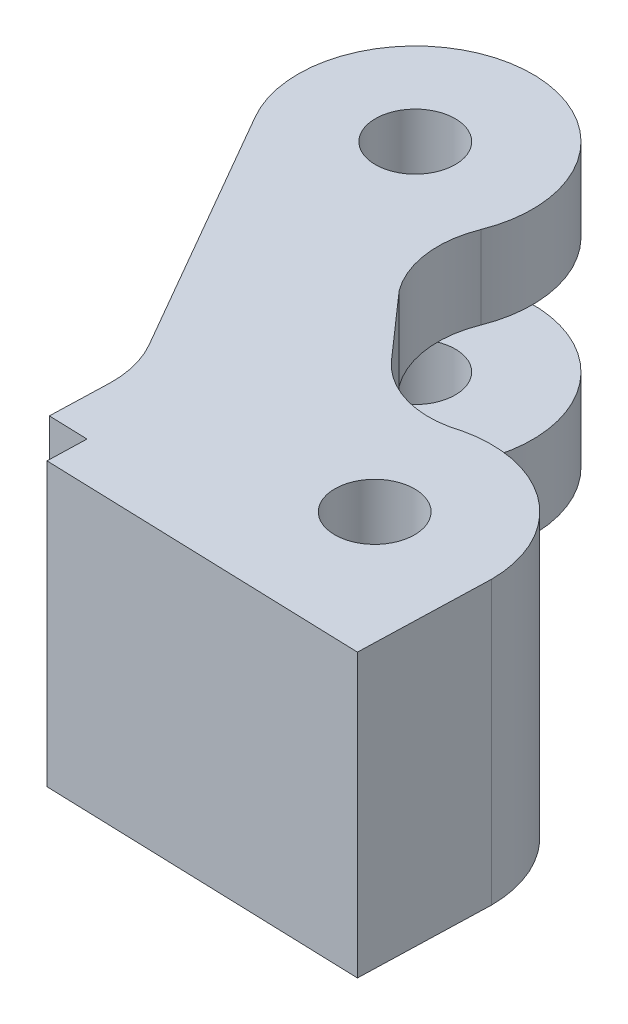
ISO-10303-21;
HEADER;
FILE_DESCRIPTION(('STEP AP214'),'2;1');
FILE_NAME('part.step','',(''),(''),'','','');
FILE_SCHEMA(('AUTOMOTIVE_DESIGN { 1 0 10303 214 1 1 1 1 }'));
ENDSEC;
DATA;
#1=APPLICATION_CONTEXT('core data for automotive mechanical design processes');
#2=APPLICATION_PROTOCOL_DEFINITION('international standard','automotive_design',2000,#1);
#3=PRODUCT_CONTEXT('',#1,'mechanical');
#4=PRODUCT('Part','Part','',(#3));
#5=PRODUCT_RELATED_PRODUCT_CATEGORY('part','',(#4));
#6=PRODUCT_DEFINITION_FORMATION('','',#4);
#7=PRODUCT_DEFINITION_CONTEXT('part definition',#1,'design');
#8=PRODUCT_DEFINITION('design','',#6,#7);
#9=PRODUCT_DEFINITION_SHAPE('','',#8);
#10=(LENGTH_UNIT() NAMED_UNIT(*) SI_UNIT(.MILLI.,.METRE.));
#11=(NAMED_UNIT(*) PLANE_ANGLE_UNIT() SI_UNIT($,.RADIAN.));
#12=(NAMED_UNIT(*) SI_UNIT($,.STERADIAN.) SOLID_ANGLE_UNIT());
#13=UNCERTAINTY_MEASURE_WITH_UNIT(LENGTH_MEASURE(1.E-05),#10,'distance_accuracy_value','');
#14=(GEOMETRIC_REPRESENTATION_CONTEXT(3) GLOBAL_UNCERTAINTY_ASSIGNED_CONTEXT((#13)) GLOBAL_UNIT_ASSIGNED_CONTEXT((#10,
#11,#12)) REPRESENTATION_CONTEXT('',''));
#15=CARTESIAN_POINT('',(0.,0.,0.));
#16=DIRECTION('',(0.,0.,1.));
#17=DIRECTION('',(1.,0.,0.));
#18=AXIS2_PLACEMENT_3D('',#15,#16,#17);
#19=CARTESIAN_POINT('',(10.2386390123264,-7.25,4.07669644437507));
#20=DIRECTION('',(0.,1.,0.));
#21=DIRECTION('',(0.,0.,1.));
#22=AXIS2_PLACEMENT_3D('',#19,#20,#21);
#23=CYLINDRICAL_SURFACE('',#22,5.);
#24=DIRECTION('',(0.,1.,0.));
#25=VECTOR('',#24,1.);
#26=CARTESIAN_POINT('',(5.59332649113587,-7.25,2.22708254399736));
#27=LINE('',#26,#25);
#28=CARTESIAN_POINT('',(5.59332649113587,-7.25,2.22708254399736));
#29=VERTEX_POINT('',#28);
#30=CARTESIAN_POINT('',(5.59332649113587,-3.,2.22708254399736));
#31=VERTEX_POINT('',#30);
#32=EDGE_CURVE('E263',#29,#31,#27,.T.);
#33=ORIENTED_EDGE('',*,*,#32,.T.);
#34=CARTESIAN_POINT('',(10.2386390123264,-3.,4.07669644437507));
#35=DIRECTION('',(0.,1.,0.));
#36=DIRECTION('',(0.,0.,1.));
#37=AXIS2_PLACEMENT_3D('',#34,#35,#36);
#38=CIRCLE('',#37,5.);
#39=CARTESIAN_POINT('',(6.2041296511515,-3.,7.03012398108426));
#40=VERTEX_POINT('',#39);
#41=EDGE_CURVE('E151',#31,#40,#38,.T.);
#42=ORIENTED_EDGE('',*,*,#41,.T.);
#43=DIRECTION('',(0.,1.,0.));
#44=VECTOR('',#43,1.);
#45=CARTESIAN_POINT('',(6.2041296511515,-7.25,7.03012398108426));
#46=LINE('',#45,#44);
#47=CARTESIAN_POINT('',(6.2041296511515,-7.25,7.03012398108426));
#48=VERTEX_POINT('',#47);
#49=EDGE_CURVE('E266',#48,#40,#46,.T.);
#50=ORIENTED_EDGE('',*,*,#49,.F.);
#51=CARTESIAN_POINT('',(10.2386390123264,-7.25,4.07669644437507));
#52=DIRECTION('',(0.,-1.,0.));
#53=DIRECTION('',(0.,0.,1.));
#54=AXIS2_PLACEMENT_3D('',#51,#52,#53);
#55=CIRCLE('',#54,5.);
#56=EDGE_CURVE('E245',#48,#29,#55,.T.);
#57=ORIENTED_EDGE('',*,*,#56,.T.);
#58=EDGE_LOOP('',(#33,#42,#50,#57));
#59=FACE_BOUND('',#58,.T.);
#60=ADVANCED_FACE('F36',(#59),#23,.F.);
#61=CARTESIAN_POINT('',(0.,-7.25,0.));
#62=DIRECTION('',(0.,1.,0.));
#63=DIRECTION('',(0.,0.,1.));
#64=AXIS2_PLACEMENT_3D('',#61,#62,#63);
#65=CYLINDRICAL_SURFACE('',#64,2.05);
#66=CARTESIAN_POINT('',(0.,-7.25,0.));
#67=DIRECTION('',(0.,1.,0.));
#68=DIRECTION('',(0.,0.,1.));
#69=AXIS2_PLACEMENT_3D('',#66,#67,#68);
#70=CIRCLE('',#69,2.05);
#71=CARTESIAN_POINT('',(0.,-7.25,2.05));
#72=VERTEX_POINT('',#71);
#73=EDGE_CURVE('E219',#72,#72,#70,.T.);
#74=CARTESIAN_POINT('',(0.,-3.,0.));
#75=DIRECTION('',(0.,1.,0.));
#76=DIRECTION('',(0.,0.,1.));
#77=AXIS2_PLACEMENT_3D('',#74,#75,#76);
#78=CIRCLE('',#77,2.05);
#79=CARTESIAN_POINT('',(0.,-3.,2.05));
#80=VERTEX_POINT('',#79);
#81=EDGE_CURVE('E283',#80,#80,#78,.F.);
#82=CARTESIAN_POINT('',(0.,-7.25,2.05));
#83=CARTESIAN_POINT('',(0.,-7.20572916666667,2.05));
#84=CARTESIAN_POINT('',(0.,-7.16145833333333,2.05));
#85=CARTESIAN_POINT('',(0.,-7.07291666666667,2.05));
#86=CARTESIAN_POINT('',(0.,-7.02864583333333,2.05));
#87=CARTESIAN_POINT('',(0.,-6.94010416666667,2.05));
#88=CARTESIAN_POINT('',(0.,-6.89583333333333,2.05));
#89=CARTESIAN_POINT('',(0.,-6.80729166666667,2.05));
#90=CARTESIAN_POINT('',(0.,-6.76302083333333,2.05));
#91=CARTESIAN_POINT('',(0.,-6.67447916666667,2.05));
#92=CARTESIAN_POINT('',(0.,-6.63020833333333,2.05));
#93=CARTESIAN_POINT('',(0.,-6.54166666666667,2.05));
#94=CARTESIAN_POINT('',(0.,-6.49739583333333,2.05));
#95=CARTESIAN_POINT('',(0.,-6.40885416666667,2.05));
#96=CARTESIAN_POINT('',(0.,-6.36458333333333,2.05));
#97=CARTESIAN_POINT('',(0.,-6.27604166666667,2.05));
#98=CARTESIAN_POINT('',(0.,-6.23177083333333,2.05));
#99=CARTESIAN_POINT('',(0.,-6.14322916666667,2.05));
#100=CARTESIAN_POINT('',(0.,-6.09895833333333,2.05));
#101=CARTESIAN_POINT('',(0.,-6.01041666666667,2.05));
#102=CARTESIAN_POINT('',(0.,-5.96614583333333,2.05));
#103=CARTESIAN_POINT('',(0.,-5.87760416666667,2.05));
#104=CARTESIAN_POINT('',(0.,-5.83333333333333,2.05));
#105=CARTESIAN_POINT('',(0.,-5.74479166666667,2.05));
#106=CARTESIAN_POINT('',(0.,-5.70052083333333,2.05));
#107=CARTESIAN_POINT('',(0.,-5.61197916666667,2.05));
#108=CARTESIAN_POINT('',(0.,-5.56770833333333,2.05));
#109=CARTESIAN_POINT('',(0.,-5.47916666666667,2.05));
#110=CARTESIAN_POINT('',(0.,-5.43489583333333,2.05));
#111=CARTESIAN_POINT('',(0.,-5.34635416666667,2.05));
#112=CARTESIAN_POINT('',(0.,-5.30208333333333,2.05));
#113=CARTESIAN_POINT('',(0.,-5.21354166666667,2.05));
#114=CARTESIAN_POINT('',(0.,-5.16927083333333,2.05));
#115=CARTESIAN_POINT('',(0.,-5.08072916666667,2.05));
#116=CARTESIAN_POINT('',(0.,-5.03645833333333,2.05));
#117=CARTESIAN_POINT('',(0.,-4.94791666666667,2.05));
#118=CARTESIAN_POINT('',(0.,-4.90364583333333,2.05));
#119=CARTESIAN_POINT('',(0.,-4.81510416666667,2.05));
#120=CARTESIAN_POINT('',(0.,-4.77083333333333,2.05));
#121=CARTESIAN_POINT('',(0.,-4.68229166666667,2.05));
#122=CARTESIAN_POINT('',(0.,-4.63802083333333,2.05));
#123=CARTESIAN_POINT('',(0.,-4.54947916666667,2.05));
#124=CARTESIAN_POINT('',(0.,-4.50520833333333,2.05));
#125=CARTESIAN_POINT('',(0.,-4.41666666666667,2.05));
#126=CARTESIAN_POINT('',(0.,-4.37239583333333,2.05));
#127=CARTESIAN_POINT('',(0.,-4.28385416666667,2.05));
#128=CARTESIAN_POINT('',(0.,-4.23958333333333,2.05));
#129=CARTESIAN_POINT('',(0.,-4.15104166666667,2.05));
#130=CARTESIAN_POINT('',(0.,-4.10677083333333,2.05));
#131=CARTESIAN_POINT('',(0.,-4.01822916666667,2.05));
#132=CARTESIAN_POINT('',(0.,-3.97395833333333,2.05));
#133=CARTESIAN_POINT('',(0.,-3.88541666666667,2.05));
#134=CARTESIAN_POINT('',(0.,-3.84114583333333,2.05));
#135=CARTESIAN_POINT('',(0.,-3.75260416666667,2.05));
#136=CARTESIAN_POINT('',(0.,-3.70833333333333,2.05));
#137=CARTESIAN_POINT('',(0.,-3.61979166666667,2.05));
#138=CARTESIAN_POINT('',(0.,-3.57552083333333,2.05));
#139=CARTESIAN_POINT('',(0.,-3.48697916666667,2.05));
#140=CARTESIAN_POINT('',(0.,-3.44270833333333,2.05));
#141=CARTESIAN_POINT('',(0.,-3.35416666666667,2.05));
#142=CARTESIAN_POINT('',(0.,-3.30989583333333,2.05));
#143=CARTESIAN_POINT('',(0.,-3.22135416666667,2.05));
#144=CARTESIAN_POINT('',(0.,-3.17708333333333,2.05));
#145=CARTESIAN_POINT('',(0.,-3.08854166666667,2.05));
#146=CARTESIAN_POINT('',(0.,-3.04427083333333,2.05));
#147=CARTESIAN_POINT('',(0.,-3.,2.05));
#148=B_SPLINE_CURVE_WITH_KNOTS('',3,(#82,#83,#84,#85,#86,#87,#88,#89,#90,#91,#92,#93,#94,#95,
#96,#97,#98,#99,#100,#101,#102,#103,#104,#105,#106,#107,#108,#109,#110,#111,#112,#113,#114,#115,
#116,#117,#118,#119,#120,#121,#122,#123,#124,#125,#126,#127,#128,#129,#130,#131,#132,#133,#134,
#135,#136,#137,#138,#139,#140,#141,#142,#143,#144,#145,#146,#147),.UNSPECIFIED.,.F.,.F.,(4,2,2,
2,2,2,2,2,2,2,2,2,2,2,2,2,2,2,2,2,2,2,2,2,2,2,2,2,2,2,2,2,4),(0.,0.1328125,0.265625,0.3984375,
0.53125,0.664062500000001,0.796875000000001,0.929687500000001,1.0625,1.1953125,1.328125,
1.4609375,1.59375,1.7265625,1.859375,1.9921875,2.125,2.2578125,2.390625,2.5234375,2.65625,
2.7890625,2.921875,3.0546875,3.1875,3.3203125,3.453125,3.5859375,3.71875,3.8515625,3.984375,
4.1171875,4.25),.UNSPECIFIED.);
#149=EDGE_CURVE('BSEAM333',#72,#80,#148,.T.);
#150=ORIENTED_EDGE('',*,*,#73,.F.);
#151=ORIENTED_EDGE('',*,*,#81,.F.);
#152=ORIENTED_EDGE('',*,*,#149,.T.);
#153=ORIENTED_EDGE('',*,*,#149,.F.);
#154=EDGE_LOOP('',(#150,#152,#151,#153));
#155=FACE_BOUND('',#154,.T.);
#156=ADVANCED_FACE('F333',(#155),#65,.F.);
#157=CARTESIAN_POINT('',(2.80122668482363,-7.25,21.6021556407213));
#158=DIRECTION('',(-0.999512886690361,0.,-0.031208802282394));
#159=DIRECTION('',(-0.031208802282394,0.,0.999512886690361));
#160=AXIS2_PLACEMENT_3D('',#157,#158,#159);
#161=PLANE('',#160);
#162=DIRECTION('',(0.,1.,0.));
#163=VECTOR('',#162,1.);
#164=CARTESIAN_POINT('',(2.80122668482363,-7.25,21.6021556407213));
#165=LINE('',#164,#163);
#166=CARTESIAN_POINT('',(2.80122668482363,-7.25,21.6021556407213));
#167=VERTEX_POINT('',#166);
#168=CARTESIAN_POINT('',(2.80122668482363,7.25,21.6021556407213));
#169=VERTEX_POINT('',#168);
#170=EDGE_CURVE('E257',#167,#169,#165,.T.);
#171=ORIENTED_EDGE('',*,*,#170,.T.);
#172=DIRECTION('',(-0.031208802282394,0.,0.999512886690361));
#173=VECTOR('',#172,1.);
#174=CARTESIAN_POINT('',(2.80122668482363,7.25,21.6021556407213));
#175=LINE('',#174,#173);
#176=CARTESIAN_POINT('',(2.89659587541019,7.25,18.5478014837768));
#177=VERTEX_POINT('',#176);
#178=EDGE_CURVE('E180',#177,#169,#175,.T.);
#179=ORIENTED_EDGE('',*,*,#178,.F.);
#180=DIRECTION('',(0.,1.,0.));
#181=VECTOR('',#180,1.);
#182=CARTESIAN_POINT('',(2.89659587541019,-7.25,18.5478014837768));
#183=LINE('',#182,#181);
#184=CARTESIAN_POINT('',(2.89659587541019,-7.25,18.5478014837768));
#185=VERTEX_POINT('',#184);
#186=EDGE_CURVE('E44',#185,#177,#183,.T.);
#187=ORIENTED_EDGE('',*,*,#186,.F.);
#188=DIRECTION('',(-0.031208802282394,0.,0.999512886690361));
#189=VECTOR('',#188,1.);
#190=CARTESIAN_POINT('',(2.80122668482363,-7.25,21.6021556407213));
#191=LINE('',#190,#189);
#192=EDGE_CURVE('E222',#185,#167,#191,.T.);
#193=ORIENTED_EDGE('',*,*,#192,.T.);
#194=EDGE_LOOP('',(#171,#179,#187,#193));
#195=FACE_BOUND('',#194,.T.);
#196=ADVANCED_FACE('F38',(#195),#161,.T.);
#197=CARTESIAN_POINT('',(-2.28185983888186,-7.25,18.4697341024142));
#198=DIRECTION('',(0.,1.,0.));
#199=DIRECTION('',(0.,0.,1.));
#200=AXIS2_PLACEMENT_3D('',#197,#198,#199);
#201=CYLINDRICAL_SURFACE('',#200,5.17904413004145);
#202=ORIENTED_EDGE('',*,*,#186,.T.);
#203=CARTESIAN_POINT('',(-2.28185983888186,7.25,18.4697341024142));
#204=DIRECTION('',(0.,-1.,0.));
#205=DIRECTION('',(0.,0.,-1.));
#206=AXIS2_PLACEMENT_3D('',#203,#204,#205);
#207=CIRCLE('',#206,5.17904413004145);
#208=CARTESIAN_POINT('',(2.20533949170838,7.25,15.8837062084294));
#209=VERTEX_POINT('',#208);
#210=EDGE_CURVE('E213',#209,#177,#207,.T.);
#211=ORIENTED_EDGE('',*,*,#210,.F.);
#212=DIRECTION('',(0.,1.,0.));
#213=VECTOR('',#212,1.);
#214=CARTESIAN_POINT('',(2.20533949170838,-7.25,15.8837062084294));
#215=LINE('',#214,#213);
#216=CARTESIAN_POINT('',(2.20533949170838,-7.25,15.8837062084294));
#217=VERTEX_POINT('',#216);
#218=EDGE_CURVE('E259',#217,#209,#215,.T.);
#219=ORIENTED_EDGE('',*,*,#218,.F.);
#220=CARTESIAN_POINT('',(-2.28185983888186,-7.25,18.4697341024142));
#221=DIRECTION('',(0.,-1.,0.));
#222=DIRECTION('',(0.,0.,-1.));
#223=AXIS2_PLACEMENT_3D('',#220,#221,#222);
#224=CIRCLE('',#223,5.17904413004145);
#225=EDGE_CURVE('E254',#217,#185,#224,.T.);
#226=ORIENTED_EDGE('',*,*,#225,.T.);
#227=EDGE_LOOP('',(#202,#211,#219,#226));
#228=FACE_BOUND('',#227,.T.);
#229=ADVANCED_FACE('F352',(#228),#201,.F.);
#230=CARTESIAN_POINT('',(-5.21616100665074,-7.25,3.00613742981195));
#231=DIRECTION('',(-0.866414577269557,0.,0.499325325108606));
#232=DIRECTION('',(0.499325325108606,0.,0.866414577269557));
#233=AXIS2_PLACEMENT_3D('',#230,#231,#232);
#234=PLANE('',#233);
#235=ORIENTED_EDGE('',*,*,#218,.T.);
#236=DIRECTION('',(0.499325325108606,0.,0.866414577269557));
#237=VECTOR('',#236,1.);
#238=CARTESIAN_POINT('',(-5.21616100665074,7.25,3.00613742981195));
#239=LINE('',#238,#237);
#240=CARTESIAN_POINT('',(-5.21616100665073,7.25,3.00613742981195));
#241=VERTEX_POINT('',#240);
#242=EDGE_CURVE('E210',#241,#209,#239,.T.);
#243=ORIENTED_EDGE('',*,*,#242,.F.);
#244=DIRECTION('',(0.,1.,0.));
#245=VECTOR('',#244,1.);
#246=CARTESIAN_POINT('',(-5.21616100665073,-7.25,3.00613742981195));
#247=LINE('',#246,#245);
#248=CARTESIAN_POINT('',(-5.21616100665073,-7.25,3.00613742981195));
#249=VERTEX_POINT('',#248);
#250=EDGE_CURVE('E261',#249,#241,#247,.T.);
#251=ORIENTED_EDGE('',*,*,#250,.F.);
#252=DIRECTION('',(0.499325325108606,0.,0.866414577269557));
#253=VECTOR('',#252,1.);
#254=CARTESIAN_POINT('',(-5.21616100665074,-7.25,3.00613742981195));
#255=LINE('',#254,#253);
#256=EDGE_CURVE('E251',#249,#217,#255,.T.);
#257=ORIENTED_EDGE('',*,*,#256,.T.);
#258=EDGE_LOOP('',(#235,#243,#251,#257));
#259=FACE_BOUND('',#258,.T.);
#260=ADVANCED_FACE('F308',(#259),#234,.T.);
#261=CARTESIAN_POINT('',(0.,-7.25,0.));
#262=DIRECTION('',(0.,1.,0.));
#263=DIRECTION('',(0.,0.,1.));
#264=AXIS2_PLACEMENT_3D('',#261,#262,#263);
#265=CYLINDRICAL_SURFACE('',#264,6.02039848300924);
#266=CARTESIAN_POINT('',(0.,3.,0.));
#267=DIRECTION('',(0.,1.,0.));
#268=DIRECTION('',(0.,0.,1.));
#269=AXIS2_PLACEMENT_3D('',#266,#267,#268);
#270=CIRCLE('',#269,6.02039848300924);
#271=CARTESIAN_POINT('',(-4.19692124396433,3.,-4.31636999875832));
#272=VERTEX_POINT('',#271);
#273=CARTESIAN_POINT('',(5.59332649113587,3.,2.22708254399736));
#274=VERTEX_POINT('',#273);
#275=EDGE_CURVE('E168',#272,#274,#270,.F.);
#276=ORIENTED_EDGE('',*,*,#275,.F.);
#277=DIRECTION('',(0.,-1.,0.));
#278=VECTOR('',#277,1.);
#279=CARTESIAN_POINT('',(-4.19692124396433,0.,-4.31636999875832));
#280=LINE('',#279,#278);
#281=CARTESIAN_POINT('',(-4.19692124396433,-3.,-4.31636999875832));
#282=VERTEX_POINT('',#281);
#283=EDGE_CURVE('E160',#272,#282,#280,.T.);
#284=ORIENTED_EDGE('',*,*,#283,.T.);
#285=CARTESIAN_POINT('',(0.,-3.,0.));
#286=DIRECTION('',(0.,1.,0.));
#287=DIRECTION('',(0.,0.,1.));
#288=AXIS2_PLACEMENT_3D('',#285,#286,#287);
#289=CIRCLE('',#288,6.02039848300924);
#290=EDGE_CURVE('E147',#282,#31,#289,.F.);
#291=ORIENTED_EDGE('',*,*,#290,.T.);
#292=ORIENTED_EDGE('',*,*,#32,.F.);
#293=CARTESIAN_POINT('',(0.,-7.25,0.));
#294=DIRECTION('',(0.,1.,0.));
#295=DIRECTION('',(0.,0.,-1.));
#296=AXIS2_PLACEMENT_3D('',#293,#294,#295);
#297=CIRCLE('',#296,6.02039848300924);
#298=EDGE_CURVE('E248',#29,#249,#297,.T.);
#299=ORIENTED_EDGE('',*,*,#298,.T.);
#300=ORIENTED_EDGE('',*,*,#250,.T.);
#301=CARTESIAN_POINT('',(0.,7.25,0.));
#302=DIRECTION('',(0.,1.,0.));
#303=DIRECTION('',(0.,0.,-1.));
#304=AXIS2_PLACEMENT_3D('',#301,#302,#303);
#305=CIRCLE('',#304,6.02039848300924);
#306=CARTESIAN_POINT('',(5.59332649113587,7.25,2.22708254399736));
#307=VERTEX_POINT('',#306);
#308=EDGE_CURVE('E207',#307,#241,#305,.T.);
#309=ORIENTED_EDGE('',*,*,#308,.F.);
#310=EDGE_CURVE('E265',#274,#307,#27,.T.);
#311=ORIENTED_EDGE('',*,*,#310,.F.);
#312=EDGE_LOOP('',(#276,#284,#291,#292,#299,#300,#309,#311));
#313=FACE_BOUND('',#312,.T.);
#314=ADVANCED_FACE('F166',(#313),#265,.T.);
#315=CARTESIAN_POINT('',(10.2386390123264,3.,4.07669644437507));
#316=DIRECTION('',(0.,1.,0.));
#317=DIRECTION('',(0.,0.,1.));
#318=AXIS2_PLACEMENT_3D('',#315,#316,#317);
#319=CIRCLE('',#318,5.);
#320=CARTESIAN_POINT('',(6.2041296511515,3.,7.03012398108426));
#321=VERTEX_POINT('',#320);
#322=EDGE_CURVE('E174',#274,#321,#319,.T.);
#323=ORIENTED_EDGE('',*,*,#322,.F.);
#324=ORIENTED_EDGE('',*,*,#310,.T.);
#325=CARTESIAN_POINT('',(10.2386390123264,7.25,4.07669644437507));
#326=DIRECTION('',(0.,-1.,0.));
#327=DIRECTION('',(0.,0.,1.));
#328=AXIS2_PLACEMENT_3D('',#325,#326,#327);
#329=CIRCLE('',#328,5.);
#330=CARTESIAN_POINT('',(6.2041296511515,7.25,7.03012398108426));
#331=VERTEX_POINT('',#330);
#332=EDGE_CURVE('E204',#331,#307,#329,.T.);
#333=ORIENTED_EDGE('',*,*,#332,.F.);
#334=EDGE_CURVE('E269',#321,#331,#46,.T.);
#335=ORIENTED_EDGE('',*,*,#334,.F.);
#336=EDGE_LOOP('',(#323,#324,#333,#335));
#337=FACE_BOUND('',#336,.T.);
#338=ADVANCED_FACE('F319',(#337),#23,.F.);
#339=CARTESIAN_POINT('',(6.2041296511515,-7.25,7.03012398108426));
#340=DIRECTION('',(0.750729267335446,0.,-0.660609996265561));
#341=DIRECTION('',(-0.660609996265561,0.,-0.750729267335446));
#342=AXIS2_PLACEMENT_3D('',#339,#340,#341);
#343=PLANE('',#342);
#344=DIRECTION('',(0.660609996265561,0.,0.750729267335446));
#345=VECTOR('',#344,1.);
#346=CARTESIAN_POINT('',(6.2041296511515,3.,7.03012398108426));
#347=LINE('',#346,#345);
#348=CARTESIAN_POINT('',(6.77920007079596,3.,7.68364451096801));
#349=VERTEX_POINT('',#348);
#350=EDGE_CURVE('E287',#321,#349,#347,.T.);
#351=ORIENTED_EDGE('',*,*,#350,.F.);
#352=ORIENTED_EDGE('',*,*,#334,.T.);
#353=DIRECTION('',(-0.660609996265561,0.,-0.750729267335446));
#354=VECTOR('',#353,1.);
#355=CARTESIAN_POINT('',(6.2041296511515,7.25,7.03012398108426));
#356=LINE('',#355,#354);
#357=CARTESIAN_POINT('',(9.1068409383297,7.25,10.3288181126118));
#358=VERTEX_POINT('',#357);
#359=EDGE_CURVE('E201',#358,#331,#356,.T.);
#360=ORIENTED_EDGE('',*,*,#359,.F.);
#361=DIRECTION('',(0.,1.,0.));
#362=VECTOR('',#361,1.);
#363=CARTESIAN_POINT('',(9.1068409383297,-7.25,10.3288181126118));
#364=LINE('',#363,#362);
#365=CARTESIAN_POINT('',(9.1068409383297,-7.25,10.3288181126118));
#366=VERTEX_POINT('',#365);
#367=EDGE_CURVE('E270',#366,#358,#364,.T.);
#368=ORIENTED_EDGE('',*,*,#367,.F.);
#369=DIRECTION('',(-0.660609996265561,0.,-0.750729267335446));
#370=VECTOR('',#369,1.);
#371=CARTESIAN_POINT('',(6.2041296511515,-7.25,7.03012398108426));
#372=LINE('',#371,#370);
#373=EDGE_CURVE('E242',#366,#48,#372,.T.);
#374=ORIENTED_EDGE('',*,*,#373,.T.);
#375=ORIENTED_EDGE('',*,*,#49,.T.);
#376=DIRECTION('',(0.660609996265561,0.,0.750729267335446));
#377=VECTOR('',#376,1.);
#378=CARTESIAN_POINT('',(6.2041296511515,-3.,7.03012398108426));
#379=LINE('',#378,#377);
#380=CARTESIAN_POINT('',(6.77920007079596,-3.,7.68364451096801));
#381=VERTEX_POINT('',#380);
#382=EDGE_CURVE('E285',#40,#381,#379,.T.);
#383=ORIENTED_EDGE('',*,*,#382,.T.);
#384=DIRECTION('',(0.,-1.,0.));
#385=VECTOR('',#384,1.);
#386=CARTESIAN_POINT('',(6.77920007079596,3.,7.68364451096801));
#387=LINE('',#386,#385);
#388=EDGE_CURVE('E11',#381,#349,#387,.F.);
#389=ORIENTED_EDGE('',*,*,#388,.T.);
#390=EDGE_LOOP('',(#351,#352,#360,#368,#374,#375,#383,#389));
#391=FACE_BOUND('',#390,.T.);
#392=ADVANCED_FACE('F297',(#391),#343,.T.);
#393=CARTESIAN_POINT('',(12.599559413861,-7.25,7.25537361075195));
#394=DIRECTION('',(0.,1.,0.));
#395=DIRECTION('',(0.,0.,1.));
#396=AXIS2_PLACEMENT_3D('',#393,#394,#395);
#397=CYLINDRICAL_SURFACE('',#396,4.65243414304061);
#398=ORIENTED_EDGE('',*,*,#367,.T.);
#399=CARTESIAN_POINT('',(12.599559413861,7.25,7.25537361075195));
#400=DIRECTION('',(0.,-1.,0.));
#401=DIRECTION('',(0.,0.,1.));
#402=AXIS2_PLACEMENT_3D('',#399,#400,#401);
#403=CIRCLE('',#402,4.65243414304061);
#404=CARTESIAN_POINT('',(14.0472358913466,7.25,11.6768412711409));
#405=VERTEX_POINT('',#404);
#406=EDGE_CURVE('E198',#405,#358,#403,.T.);
#407=ORIENTED_EDGE('',*,*,#406,.F.);
#408=DIRECTION('',(0.,1.,0.));
#409=VECTOR('',#408,1.);
#410=CARTESIAN_POINT('',(14.0472358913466,-7.25,11.6768412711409));
#411=LINE('',#410,#409);
#412=CARTESIAN_POINT('',(14.0472358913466,-7.25,11.6768412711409));
#413=VERTEX_POINT('',#412);
#414=EDGE_CURVE('E272',#413,#405,#411,.T.);
#415=ORIENTED_EDGE('',*,*,#414,.F.);
#416=CARTESIAN_POINT('',(12.599559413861,-7.25,7.25537361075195));
#417=DIRECTION('',(0.,-1.,0.));
#418=DIRECTION('',(0.,0.,1.));
#419=AXIS2_PLACEMENT_3D('',#416,#417,#418);
#420=CIRCLE('',#419,4.65243414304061);
#421=EDGE_CURVE('E239',#413,#366,#420,.T.);
#422=ORIENTED_EDGE('',*,*,#421,.T.);
#423=EDGE_LOOP('',(#398,#407,#415,#422));
#424=FACE_BOUND('',#423,.T.);
#425=ADVANCED_FACE('F348',(#424),#397,.F.);
#426=CARTESIAN_POINT('',(15.428728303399,-7.25,17.5156321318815));
#427=DIRECTION('',(0.,1.,0.));
#428=DIRECTION('',(0.,0.,1.));
#429=AXIS2_PLACEMENT_3D('',#426,#427,#428);
#430=CYLINDRICAL_SURFACE('',#429,6.00000000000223);
#431=ORIENTED_EDGE('',*,*,#414,.T.);
#432=CARTESIAN_POINT('',(15.428728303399,7.25,17.5156321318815));
#433=DIRECTION('',(0.,1.,0.));
#434=DIRECTION('',(0.,0.,1.));
#435=AXIS2_PLACEMENT_3D('',#432,#433,#434);
#436=CIRCLE('',#435,6.00000000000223);
#437=CARTESIAN_POINT('',(21.4287283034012,7.25,17.5156321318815));
#438=VERTEX_POINT('',#437);
#439=EDGE_CURVE('E195',#438,#405,#436,.T.);
#440=ORIENTED_EDGE('',*,*,#439,.F.);
#441=DIRECTION('',(0.,1.,0.));
#442=VECTOR('',#441,1.);
#443=CARTESIAN_POINT('',(21.4287283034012,-7.25,17.5156321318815));
#444=LINE('',#443,#442);
#445=CARTESIAN_POINT('',(21.4287283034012,-7.25,17.5156321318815));
#446=VERTEX_POINT('',#445);
#447=EDGE_CURVE('E274',#446,#438,#444,.T.);
#448=ORIENTED_EDGE('',*,*,#447,.F.);
#449=CARTESIAN_POINT('',(15.428728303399,-7.25,17.5156321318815));
#450=DIRECTION('',(0.,1.,0.));
#451=DIRECTION('',(0.,0.,1.));
#452=AXIS2_PLACEMENT_3D('',#449,#450,#451);
#453=CIRCLE('',#452,6.00000000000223);
#454=EDGE_CURVE('E236',#446,#413,#453,.T.);
#455=ORIENTED_EDGE('',*,*,#454,.T.);
#456=EDGE_LOOP('',(#431,#440,#448,#455));
#457=FACE_BOUND('',#456,.T.);
#458=ADVANCED_FACE('F466',(#457),#430,.T.);
#459=CARTESIAN_POINT('',(21.2266724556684,-7.25,24.2007933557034));
#460=DIRECTION('',(0.999543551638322,0.,0.0302107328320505));
#461=DIRECTION('',(0.0302107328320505,0.,-0.999543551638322));
#462=AXIS2_PLACEMENT_3D('',#459,#460,#461);
#463=PLANE('',#462);
#464=ORIENTED_EDGE('',*,*,#447,.T.);
#465=DIRECTION('',(0.0302107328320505,0.,-0.999543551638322));
#466=VECTOR('',#465,1.);
#467=CARTESIAN_POINT('',(21.2266724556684,7.25,24.2007933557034));
#468=LINE('',#467,#466);
#469=CARTESIAN_POINT('',(21.2266724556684,7.25,24.2007933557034));
#470=VERTEX_POINT('',#469);
#471=EDGE_CURVE('E192',#470,#438,#468,.T.);
#472=ORIENTED_EDGE('',*,*,#471,.F.);
#473=DIRECTION('',(0.,1.,0.));
#474=VECTOR('',#473,1.);
#475=CARTESIAN_POINT('',(21.2266724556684,-7.25,24.2007933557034));
#476=LINE('',#475,#474);
#477=CARTESIAN_POINT('',(21.2266724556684,-7.25,24.2007933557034));
#478=VERTEX_POINT('',#477);
#479=EDGE_CURVE('E276',#478,#470,#476,.T.);
#480=ORIENTED_EDGE('',*,*,#479,.F.);
#481=DIRECTION('',(0.0302107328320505,0.,-0.999543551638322));
#482=VECTOR('',#481,1.);
#483=CARTESIAN_POINT('',(21.2266724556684,-7.25,24.2007933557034));
#484=LINE('',#483,#482);
#485=EDGE_CURVE('E233',#478,#446,#484,.T.);
#486=ORIENTED_EDGE('',*,*,#485,.T.);
#487=EDGE_LOOP('',(#464,#472,#480,#486));
#488=FACE_BOUND('',#487,.T.);
#489=ADVANCED_FACE('F456',(#488),#463,.T.);
#490=CARTESIAN_POINT('',(21.2266724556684,-7.25,24.2007933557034));
#491=DIRECTION('',(-0.0324976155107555,0.,0.999471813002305));
#492=DIRECTION('',(0.999471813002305,0.,0.0324976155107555));
#493=AXIS2_PLACEMENT_3D('',#490,#491,#492);
#494=PLANE('',#493);
#495=ORIENTED_EDGE('',*,*,#479,.T.);
#496=DIRECTION('',(0.999471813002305,0.,0.0324976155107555));
#497=VECTOR('',#496,1.);
#498=CARTESIAN_POINT('',(21.2266724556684,7.25,24.2007933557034));
#499=LINE('',#498,#497);
#500=CARTESIAN_POINT('',(4.74182795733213,7.25,23.6647921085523));
#501=VERTEX_POINT('',#500);
#502=EDGE_CURVE('E189',#501,#470,#499,.T.);
#503=ORIENTED_EDGE('',*,*,#502,.F.);
#504=DIRECTION('',(0.,1.,0.));
#505=VECTOR('',#504,1.);
#506=CARTESIAN_POINT('',(4.74182795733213,-7.25,23.6647921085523));
#507=LINE('',#506,#505);
#508=CARTESIAN_POINT('',(4.74182795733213,-7.25,23.6647921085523));
#509=VERTEX_POINT('',#508);
#510=EDGE_CURVE('E278',#509,#501,#507,.T.);
#511=ORIENTED_EDGE('',*,*,#510,.F.);
#512=DIRECTION('',(0.999471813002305,0.,0.0324976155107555));
#513=VECTOR('',#512,1.);
#514=CARTESIAN_POINT('',(21.2266724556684,-7.25,24.2007933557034));
#515=LINE('',#514,#513);
#516=EDGE_CURVE('E230',#509,#478,#515,.T.);
#517=ORIENTED_EDGE('',*,*,#516,.T.);
#518=EDGE_LOOP('',(#495,#503,#511,#517));
#519=FACE_BOUND('',#518,.T.);
#520=ADVANCED_FACE('F446',(#519),#494,.T.);
#521=CARTESIAN_POINT('',(4.80017624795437,-7.25,21.6669868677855));
#522=DIRECTION('',(-0.999573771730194,0.,-0.0291937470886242));
#523=DIRECTION('',(-0.0291937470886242,0.,0.999573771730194));
#524=AXIS2_PLACEMENT_3D('',#521,#522,#523);
#525=PLANE('',#524);
#526=ORIENTED_EDGE('',*,*,#510,.T.);
#527=DIRECTION('',(-0.0291937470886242,0.,0.999573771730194));
#528=VECTOR('',#527,1.);
#529=CARTESIAN_POINT('',(4.80017624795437,7.25,21.6669868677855));
#530=LINE('',#529,#528);
#531=CARTESIAN_POINT('',(4.80017624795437,7.25,21.6669868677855));
#532=VERTEX_POINT('',#531);
#533=EDGE_CURVE('E186',#532,#501,#530,.T.);
#534=ORIENTED_EDGE('',*,*,#533,.F.);
#535=DIRECTION('',(0.,1.,0.));
#536=VECTOR('',#535,1.);
#537=CARTESIAN_POINT('',(4.80017624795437,-7.25,21.6669868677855));
#538=LINE('',#537,#536);
#539=CARTESIAN_POINT('',(4.80017624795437,-7.25,21.6669868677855));
#540=VERTEX_POINT('',#539);
#541=EDGE_CURVE('E280',#540,#532,#538,.T.);
#542=ORIENTED_EDGE('',*,*,#541,.F.);
#543=DIRECTION('',(-0.0291937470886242,0.,0.999573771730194));
#544=VECTOR('',#543,1.);
#545=CARTESIAN_POINT('',(4.80017624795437,-7.25,21.6669868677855));
#546=LINE('',#545,#544);
#547=EDGE_CURVE('E227',#540,#509,#546,.T.);
#548=ORIENTED_EDGE('',*,*,#547,.T.);
#549=EDGE_LOOP('',(#526,#534,#542,#548));
#550=FACE_BOUND('',#549,.T.);
#551=ADVANCED_FACE('F437',(#550),#525,.T.);
#552=CARTESIAN_POINT('',(2.80122668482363,-7.25,21.6021556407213));
#553=DIRECTION('',(-0.0324156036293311,0.,0.999474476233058));
#554=DIRECTION('',(0.999474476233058,0.,0.0324156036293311));
#555=AXIS2_PLACEMENT_3D('',#552,#553,#554);
#556=PLANE('',#555);
#557=ORIENTED_EDGE('',*,*,#541,.T.);
#558=DIRECTION('',(0.999474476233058,0.,0.0324156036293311));
#559=VECTOR('',#558,1.);
#560=CARTESIAN_POINT('',(2.80122668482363,7.25,21.6021556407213));
#561=LINE('',#560,#559);
#562=EDGE_CURVE('E183',#169,#532,#561,.T.);
#563=ORIENTED_EDGE('',*,*,#562,.F.);
#564=ORIENTED_EDGE('',*,*,#170,.F.);
#565=DIRECTION('',(0.999474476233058,0.,0.0324156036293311));
#566=VECTOR('',#565,1.);
#567=CARTESIAN_POINT('',(2.80122668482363,-7.25,21.6021556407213));
#568=LINE('',#567,#566);
#569=EDGE_CURVE('E224',#167,#540,#568,.T.);
#570=ORIENTED_EDGE('',*,*,#569,.T.);
#571=EDGE_LOOP('',(#557,#563,#564,#570));
#572=FACE_BOUND('',#571,.T.);
#573=ADVANCED_FACE('F359',(#572),#556,.T.);
#574=CARTESIAN_POINT('',(-2.28185983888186,-7.25,18.4697341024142));
#575=DIRECTION('',(0.,-1.,0.));
#576=DIRECTION('',(0.,0.,-1.));
#577=AXIS2_PLACEMENT_3D('',#574,#575,#576);
#578=PLANE('',#577);
#579=CARTESIAN_POINT('',(15.428728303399,-7.25,17.5156321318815));
#580=DIRECTION('',(0.,1.,0.));
#581=DIRECTION('',(0.,0.,1.));
#582=AXIS2_PLACEMENT_3D('',#579,#580,#581);
#583=CIRCLE('',#582,2.05);
#584=CARTESIAN_POINT('',(15.428728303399,-7.25,19.5656321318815));
#585=VERTEX_POINT('',#584);
#586=EDGE_CURVE('E216',#585,#585,#583,.T.);
#587=ORIENTED_EDGE('',*,*,#586,.T.);
#588=EDGE_LOOP('',(#587));
#589=FACE_BOUND('',#588,.T.);
#590=ORIENTED_EDGE('',*,*,#73,.T.);
#591=EDGE_LOOP('',(#590));
#592=FACE_BOUND('',#591,.T.);
#593=ORIENTED_EDGE('',*,*,#192,.F.);
#594=ORIENTED_EDGE('',*,*,#225,.F.);
#595=ORIENTED_EDGE('',*,*,#256,.F.);
#596=ORIENTED_EDGE('',*,*,#298,.F.);
#597=ORIENTED_EDGE('',*,*,#56,.F.);
#598=ORIENTED_EDGE('',*,*,#373,.F.);
#599=ORIENTED_EDGE('',*,*,#421,.F.);
#600=ORIENTED_EDGE('',*,*,#454,.F.);
#601=ORIENTED_EDGE('',*,*,#485,.F.);
#602=ORIENTED_EDGE('',*,*,#516,.F.);
#603=ORIENTED_EDGE('',*,*,#547,.F.);
#604=ORIENTED_EDGE('',*,*,#569,.F.);
#605=EDGE_LOOP('',(#593,#594,#595,#596,#597,#598,#599,#600,#601,#602,#603,#604));
#606=FACE_BOUND('',#605,.T.);
#607=ADVANCED_FACE('F304',(#589,#592,#606),#578,.T.);
#608=CARTESIAN_POINT('',(0.,3.,0.));
#609=DIRECTION('',(0.,1.,0.));
#610=DIRECTION('',(0.,0.,1.));
#611=AXIS2_PLACEMENT_3D('',#608,#609,#610);
#612=CIRCLE('',#611,2.05);
#613=CARTESIAN_POINT('',(0.,3.,2.05));
#614=VERTEX_POINT('',#613);
#615=EDGE_CURVE('E155',#614,#614,#612,.F.);
#616=CARTESIAN_POINT('',(0.,7.25,0.));
#617=DIRECTION('',(0.,1.,0.));
#618=DIRECTION('',(0.,0.,1.));
#619=AXIS2_PLACEMENT_3D('',#616,#617,#618);
#620=CIRCLE('',#619,2.05);
#621=CARTESIAN_POINT('',(0.,7.25,2.05));
#622=VERTEX_POINT('',#621);
#623=EDGE_CURVE('E172',#622,#622,#620,.T.);
#624=CARTESIAN_POINT('',(0.,3.,2.05));
#625=CARTESIAN_POINT('',(0.,3.04427083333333,2.05));
#626=CARTESIAN_POINT('',(0.,3.08854166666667,2.05));
#627=CARTESIAN_POINT('',(0.,3.17708333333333,2.05));
#628=CARTESIAN_POINT('',(0.,3.22135416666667,2.05));
#629=CARTESIAN_POINT('',(0.,3.30989583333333,2.05));
#630=CARTESIAN_POINT('',(0.,3.35416666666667,2.05));
#631=CARTESIAN_POINT('',(0.,3.44270833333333,2.05));
#632=CARTESIAN_POINT('',(0.,3.48697916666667,2.05));
#633=CARTESIAN_POINT('',(0.,3.57552083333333,2.05));
#634=CARTESIAN_POINT('',(0.,3.61979166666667,2.05));
#635=CARTESIAN_POINT('',(0.,3.70833333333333,2.05));
#636=CARTESIAN_POINT('',(0.,3.75260416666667,2.05));
#637=CARTESIAN_POINT('',(0.,3.84114583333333,2.05));
#638=CARTESIAN_POINT('',(0.,3.88541666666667,2.05));
#639=CARTESIAN_POINT('',(0.,3.97395833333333,2.05));
#640=CARTESIAN_POINT('',(0.,4.01822916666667,2.05));
#641=CARTESIAN_POINT('',(0.,4.10677083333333,2.05));
#642=CARTESIAN_POINT('',(0.,4.15104166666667,2.05));
#643=CARTESIAN_POINT('',(0.,4.23958333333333,2.05));
#644=CARTESIAN_POINT('',(0.,4.28385416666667,2.05));
#645=CARTESIAN_POINT('',(0.,4.37239583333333,2.05));
#646=CARTESIAN_POINT('',(0.,4.41666666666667,2.05));
#647=CARTESIAN_POINT('',(0.,4.50520833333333,2.05));
#648=CARTESIAN_POINT('',(0.,4.54947916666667,2.05));
#649=CARTESIAN_POINT('',(0.,4.63802083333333,2.05));
#650=CARTESIAN_POINT('',(0.,4.68229166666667,2.05));
#651=CARTESIAN_POINT('',(0.,4.77083333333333,2.05));
#652=CARTESIAN_POINT('',(0.,4.81510416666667,2.05));
#653=CARTESIAN_POINT('',(0.,4.90364583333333,2.05));
#654=CARTESIAN_POINT('',(0.,4.94791666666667,2.05));
#655=CARTESIAN_POINT('',(0.,5.03645833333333,2.05));
#656=CARTESIAN_POINT('',(0.,5.08072916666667,2.05));
#657=CARTESIAN_POINT('',(0.,5.16927083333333,2.05));
#658=CARTESIAN_POINT('',(0.,5.21354166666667,2.05));
#659=CARTESIAN_POINT('',(0.,5.30208333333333,2.05));
#660=CARTESIAN_POINT('',(0.,5.34635416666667,2.05));
#661=CARTESIAN_POINT('',(0.,5.43489583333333,2.05));
#662=CARTESIAN_POINT('',(0.,5.47916666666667,2.05));
#663=CARTESIAN_POINT('',(0.,5.56770833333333,2.05));
#664=CARTESIAN_POINT('',(0.,5.61197916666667,2.05));
#665=CARTESIAN_POINT('',(0.,5.70052083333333,2.05));
#666=CARTESIAN_POINT('',(0.,5.74479166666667,2.05));
#667=CARTESIAN_POINT('',(0.,5.83333333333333,2.05));
#668=CARTESIAN_POINT('',(0.,5.87760416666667,2.05));
#669=CARTESIAN_POINT('',(0.,5.96614583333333,2.05));
#670=CARTESIAN_POINT('',(0.,6.01041666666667,2.05));
#671=CARTESIAN_POINT('',(0.,6.09895833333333,2.05));
#672=CARTESIAN_POINT('',(0.,6.14322916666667,2.05));
#673=CARTESIAN_POINT('',(0.,6.23177083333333,2.05));
#674=CARTESIAN_POINT('',(0.,6.27604166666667,2.05));
#675=CARTESIAN_POINT('',(0.,6.36458333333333,2.05));
#676=CARTESIAN_POINT('',(0.,6.40885416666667,2.05));
#677=CARTESIAN_POINT('',(0.,6.49739583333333,2.05));
#678=CARTESIAN_POINT('',(0.,6.54166666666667,2.05));
#679=CARTESIAN_POINT('',(0.,6.63020833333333,2.05));
#680=CARTESIAN_POINT('',(0.,6.67447916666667,2.05));
#681=CARTESIAN_POINT('',(0.,6.76302083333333,2.05));
#682=CARTESIAN_POINT('',(0.,6.80729166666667,2.05));
#683=CARTESIAN_POINT('',(0.,6.89583333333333,2.05));
#684=CARTESIAN_POINT('',(0.,6.94010416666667,2.05));
#685=CARTESIAN_POINT('',(0.,7.02864583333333,2.05));
#686=CARTESIAN_POINT('',(0.,7.07291666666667,2.05));
#687=CARTESIAN_POINT('',(0.,7.16145833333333,2.05));
#688=CARTESIAN_POINT('',(0.,7.20572916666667,2.05));
#689=CARTESIAN_POINT('',(0.,7.25,2.05));
#690=B_SPLINE_CURVE_WITH_KNOTS('',3,(#624,#625,#626,#627,#628,#629,#630,#631,#632,#633,#634,
#635,#636,#637,#638,#639,#640,#641,#642,#643,#644,#645,#646,#647,#648,#649,#650,#651,#652,#653,
#654,#655,#656,#657,#658,#659,#660,#661,#662,#663,#664,#665,#666,#667,#668,#669,#670,#671,#672,
#673,#674,#675,#676,#677,#678,#679,#680,#681,#682,#683,#684,#685,#686,#687,#688,#689),
.UNSPECIFIED.,.F.,.F.,(4,2,2,2,2,2,2,2,2,2,2,2,2,2,2,2,2,2,2,2,2,2,2,2,2,2,2,2,2,2,2,2,4),(0.,
0.132812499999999,0.265625,0.3984375,0.53125,0.6640625,0.796875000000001,0.9296875,1.0625,
1.1953125,1.328125,1.4609375,1.59375,1.7265625,1.859375,1.9921875,2.125,2.2578125,2.390625,
2.5234375,2.65625,2.7890625,2.921875,3.0546875,3.1875,3.3203125,3.453125,3.5859375,3.71875,
3.8515625,3.984375,4.1171875,4.25),.UNSPECIFIED.);
#691=EDGE_CURVE('BSEAM340',#614,#622,#690,.T.);
#692=ORIENTED_EDGE('',*,*,#615,.T.);
#693=ORIENTED_EDGE('',*,*,#623,.T.);
#694=ORIENTED_EDGE('',*,*,#691,.T.);
#695=ORIENTED_EDGE('',*,*,#691,.F.);
#696=EDGE_LOOP('',(#692,#694,#693,#695));
#697=FACE_BOUND('',#696,.T.);
#698=ADVANCED_FACE('F340',(#697),#65,.F.);
#699=CARTESIAN_POINT('',(15.428728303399,-7.25,17.5156321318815));
#700=DIRECTION('',(0.,1.,0.));
#701=DIRECTION('',(0.,0.,1.));
#702=AXIS2_PLACEMENT_3D('',#699,#700,#701);
#703=CYLINDRICAL_SURFACE('',#702,2.05);
#704=CARTESIAN_POINT('',(15.428728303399,7.25,17.5156321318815));
#705=DIRECTION('',(0.,1.,0.));
#706=DIRECTION('',(0.,0.,1.));
#707=AXIS2_PLACEMENT_3D('',#704,#705,#706);
#708=CIRCLE('',#707,2.05);
#709=CARTESIAN_POINT('',(15.428728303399,7.25,19.5656321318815));
#710=VERTEX_POINT('',#709);
#711=EDGE_CURVE('E169',#710,#710,#708,.T.);
#712=CARTESIAN_POINT('',(15.428728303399,-7.25,19.5656321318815));
#713=CARTESIAN_POINT('',(15.428728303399,-7.09895833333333,19.5656321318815));
#714=CARTESIAN_POINT('',(15.428728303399,-6.94791666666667,19.5656321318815));
#715=CARTESIAN_POINT('',(15.428728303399,-6.64583333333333,19.5656321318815));
#716=CARTESIAN_POINT('',(15.428728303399,-6.49479166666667,19.5656321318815));
#717=CARTESIAN_POINT('',(15.428728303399,-6.19270833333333,19.5656321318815));
#718=CARTESIAN_POINT('',(15.428728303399,-6.04166666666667,19.5656321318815));
#719=CARTESIAN_POINT('',(15.428728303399,-5.73958333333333,19.5656321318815));
#720=CARTESIAN_POINT('',(15.428728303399,-5.58854166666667,19.5656321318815));
#721=CARTESIAN_POINT('',(15.428728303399,-5.28645833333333,19.5656321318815));
#722=CARTESIAN_POINT('',(15.428728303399,-5.13541666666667,19.5656321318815));
#723=CARTESIAN_POINT('',(15.428728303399,-4.83333333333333,19.5656321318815));
#724=CARTESIAN_POINT('',(15.428728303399,-4.68229166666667,19.5656321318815));
#725=CARTESIAN_POINT('',(15.428728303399,-4.38020833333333,19.5656321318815));
#726=CARTESIAN_POINT('',(15.428728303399,-4.22916666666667,19.5656321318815));
#727=CARTESIAN_POINT('',(15.428728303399,-3.92708333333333,19.5656321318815));
#728=CARTESIAN_POINT('',(15.428728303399,-3.77604166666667,19.5656321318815));
#729=CARTESIAN_POINT('',(15.428728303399,-3.47395833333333,19.5656321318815));
#730=CARTESIAN_POINT('',(15.428728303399,-3.32291666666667,19.5656321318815));
#731=CARTESIAN_POINT('',(15.428728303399,-3.02083333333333,19.5656321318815));
#732=CARTESIAN_POINT('',(15.428728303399,-2.86979166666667,19.5656321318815));
#733=CARTESIAN_POINT('',(15.428728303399,-2.56770833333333,19.5656321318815));
#734=CARTESIAN_POINT('',(15.428728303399,-2.41666666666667,19.5656321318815));
#735=CARTESIAN_POINT('',(15.428728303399,-2.11458333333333,19.5656321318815));
#736=CARTESIAN_POINT('',(15.428728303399,-1.96354166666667,19.5656321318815));
#737=CARTESIAN_POINT('',(15.428728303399,-1.66145833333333,19.5656321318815));
#738=CARTESIAN_POINT('',(15.428728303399,-1.51041666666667,19.5656321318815));
#739=CARTESIAN_POINT('',(15.428728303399,-1.20833333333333,19.5656321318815));
#740=CARTESIAN_POINT('',(15.428728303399,-1.05729166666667,19.5656321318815));
#741=CARTESIAN_POINT('',(15.428728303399,-0.755208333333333,19.5656321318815));
#742=CARTESIAN_POINT('',(15.428728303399,-0.604166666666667,19.5656321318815));
#743=CARTESIAN_POINT('',(15.428728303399,-0.302083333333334,19.5656321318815));
#744=CARTESIAN_POINT('',(15.428728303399,-0.151041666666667,19.5656321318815));
#745=CARTESIAN_POINT('',(15.428728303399,0.151041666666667,19.5656321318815));
#746=CARTESIAN_POINT('',(15.428728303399,0.302083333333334,19.5656321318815));
#747=CARTESIAN_POINT('',(15.428728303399,0.604166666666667,19.5656321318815));
#748=CARTESIAN_POINT('',(15.428728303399,0.755208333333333,19.5656321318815));
#749=CARTESIAN_POINT('',(15.428728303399,1.05729166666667,19.5656321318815));
#750=CARTESIAN_POINT('',(15.428728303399,1.20833333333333,19.5656321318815));
#751=CARTESIAN_POINT('',(15.428728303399,1.51041666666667,19.5656321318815));
#752=CARTESIAN_POINT('',(15.428728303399,1.66145833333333,19.5656321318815));
#753=CARTESIAN_POINT('',(15.428728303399,1.96354166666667,19.5656321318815));
#754=CARTESIAN_POINT('',(15.428728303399,2.11458333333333,19.5656321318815));
#755=CARTESIAN_POINT('',(15.428728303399,2.41666666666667,19.5656321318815));
#756=CARTESIAN_POINT('',(15.428728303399,2.56770833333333,19.5656321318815));
#757=CARTESIAN_POINT('',(15.428728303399,2.86979166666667,19.5656321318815));
#758=CARTESIAN_POINT('',(15.428728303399,3.02083333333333,19.5656321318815));
#759=CARTESIAN_POINT('',(15.428728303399,3.32291666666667,19.5656321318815));
#760=CARTESIAN_POINT('',(15.428728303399,3.47395833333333,19.5656321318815));
#761=CARTESIAN_POINT('',(15.428728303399,3.77604166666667,19.5656321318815));
#762=CARTESIAN_POINT('',(15.428728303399,3.92708333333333,19.5656321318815));
#763=CARTESIAN_POINT('',(15.428728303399,4.22916666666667,19.5656321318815));
#764=CARTESIAN_POINT('',(15.428728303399,4.38020833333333,19.5656321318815));
#765=CARTESIAN_POINT('',(15.428728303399,4.68229166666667,19.5656321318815));
#766=CARTESIAN_POINT('',(15.428728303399,4.83333333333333,19.5656321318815));
#767=CARTESIAN_POINT('',(15.428728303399,5.13541666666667,19.5656321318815));
#768=CARTESIAN_POINT('',(15.428728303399,5.28645833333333,19.5656321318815));
#769=CARTESIAN_POINT('',(15.428728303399,5.58854166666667,19.5656321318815));
#770=CARTESIAN_POINT('',(15.428728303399,5.73958333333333,19.5656321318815));
#771=CARTESIAN_POINT('',(15.428728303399,6.04166666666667,19.5656321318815));
#772=CARTESIAN_POINT('',(15.428728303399,6.19270833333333,19.5656321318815));
#773=CARTESIAN_POINT('',(15.428728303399,6.49479166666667,19.5656321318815));
#774=CARTESIAN_POINT('',(15.428728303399,6.64583333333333,19.5656321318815));
#775=CARTESIAN_POINT('',(15.428728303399,6.94791666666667,19.5656321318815));
#776=CARTESIAN_POINT('',(15.428728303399,7.09895833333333,19.5656321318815));
#777=CARTESIAN_POINT('',(15.428728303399,7.25,19.5656321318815));
#778=B_SPLINE_CURVE_WITH_KNOTS('',3,(#712,#713,#714,#715,#716,#717,#718,#719,#720,#721,#722,
#723,#724,#725,#726,#727,#728,#729,#730,#731,#732,#733,#734,#735,#736,#737,#738,#739,#740,#741,
#742,#743,#744,#745,#746,#747,#748,#749,#750,#751,#752,#753,#754,#755,#756,#757,#758,#759,#760,
#761,#762,#763,#764,#765,#766,#767,#768,#769,#770,#771,#772,#773,#774,#775,#776,#777),
.UNSPECIFIED.,.F.,.F.,(4,2,2,2,2,2,2,2,2,2,2,2,2,2,2,2,2,2,2,2,2,2,2,2,2,2,2,2,2,2,2,2,4),(0.,
0.453125,0.90625,1.359375,1.8125,2.265625,2.71875,3.171875,3.625,4.078125,4.53125,4.984375,
5.4375,5.890625,6.34375,6.796875,7.25,7.703125,8.15625,8.609375,9.0625,9.515625,9.96875,
10.421875,10.875,11.328125,11.78125,12.234375,12.6875,13.140625,13.59375,14.046875,14.5),.UNSPECIFIED.);
#779=EDGE_CURVE('BSEAM329',#585,#710,#778,.T.);
#780=ORIENTED_EDGE('',*,*,#586,.F.);
#781=ORIENTED_EDGE('',*,*,#711,.T.);
#782=ORIENTED_EDGE('',*,*,#779,.T.);
#783=ORIENTED_EDGE('',*,*,#779,.F.);
#784=EDGE_LOOP('',(#780,#782,#781,#783));
#785=FACE_BOUND('',#784,.T.);
#786=ADVANCED_FACE('F329',(#785),#703,.F.);
#787=CARTESIAN_POINT('',(-2.28185983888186,7.25,18.4697341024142));
#788=DIRECTION('',(0.,-1.,0.));
#789=DIRECTION('',(0.,0.,-1.));
#790=AXIS2_PLACEMENT_3D('',#787,#788,#789);
#791=PLANE('',#790);
#792=ORIENTED_EDGE('',*,*,#178,.T.);
#793=ORIENTED_EDGE('',*,*,#562,.T.);
#794=ORIENTED_EDGE('',*,*,#533,.T.);
#795=ORIENTED_EDGE('',*,*,#502,.T.);
#796=ORIENTED_EDGE('',*,*,#471,.T.);
#797=ORIENTED_EDGE('',*,*,#439,.T.);
#798=ORIENTED_EDGE('',*,*,#406,.T.);
#799=ORIENTED_EDGE('',*,*,#359,.T.);
#800=ORIENTED_EDGE('',*,*,#332,.T.);
#801=ORIENTED_EDGE('',*,*,#308,.T.);
#802=ORIENTED_EDGE('',*,*,#242,.T.);
#803=ORIENTED_EDGE('',*,*,#210,.T.);
#804=EDGE_LOOP('',(#792,#793,#794,#795,#796,#797,#798,#799,#800,#801,#802,#803));
#805=FACE_BOUND('',#804,.T.);
#806=ORIENTED_EDGE('',*,*,#623,.F.);
#807=EDGE_LOOP('',(#806));
#808=FACE_BOUND('',#807,.T.);
#809=ORIENTED_EDGE('',*,*,#711,.F.);
#810=EDGE_LOOP('',(#809));
#811=FACE_BOUND('',#810,.T.);
#812=ADVANCED_FACE('F312',(#805,#808,#811),#791,.F.);
#813=CARTESIAN_POINT('',(5.58618469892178,3.,-2.24493616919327));
#814=DIRECTION('',(0.,1.,0.));
#815=DIRECTION('',(0.,0.,1.));
#816=AXIS2_PLACEMENT_3D('',#813,#814,#815);
#817=PLANE('',#816);
#818=ORIENTED_EDGE('',*,*,#275,.T.);
#819=ORIENTED_EDGE('',*,*,#322,.T.);
#820=ORIENTED_EDGE('',*,*,#350,.T.);
#821=CARTESIAN_POINT('',(5.58618469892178,3.,-2.24493616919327));
#822=DIRECTION('',(0.,1.,0.));
#823=DIRECTION('',(0.,0.,1.));
#824=AXIS2_PLACEMENT_3D('',#821,#822,#823);
#825=CIRCLE('',#824,10.);
#826=EDGE_CURVE('E163',#272,#349,#825,.T.);
#827=ORIENTED_EDGE('',*,*,#826,.F.);
#828=EDGE_LOOP('',(#818,#819,#820,#827));
#829=FACE_BOUND('',#828,.T.);
#830=ORIENTED_EDGE('',*,*,#615,.F.);
#831=EDGE_LOOP('',(#830));
#832=FACE_BOUND('',#831,.T.);
#833=ADVANCED_FACE('F320',(#829,#832),#817,.F.);
#834=CARTESIAN_POINT('',(5.58618469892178,-3.,-2.24493616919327));
#835=DIRECTION('',(0.,1.,0.));
#836=DIRECTION('',(0.,0.,1.));
#837=AXIS2_PLACEMENT_3D('',#834,#835,#836);
#838=PLANE('',#837);
#839=CARTESIAN_POINT('',(5.58618469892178,-3.,-2.24493616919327));
#840=DIRECTION('',(0.,1.,0.));
#841=DIRECTION('',(0.,0.,1.));
#842=AXIS2_PLACEMENT_3D('',#839,#840,#841);
#843=CIRCLE('',#842,10.);
#844=EDGE_CURVE('E51',#282,#381,#843,.T.);
#845=ORIENTED_EDGE('',*,*,#844,.T.);
#846=ORIENTED_EDGE('',*,*,#382,.F.);
#847=ORIENTED_EDGE('',*,*,#41,.F.);
#848=ORIENTED_EDGE('',*,*,#290,.F.);
#849=EDGE_LOOP('',(#845,#846,#847,#848));
#850=FACE_BOUND('',#849,.T.);
#851=ORIENTED_EDGE('',*,*,#81,.T.);
#852=EDGE_LOOP('',(#851));
#853=FACE_BOUND('',#852,.T.);
#854=ADVANCED_FACE('F148',(#850,#853),#838,.T.);
#855=CARTESIAN_POINT('',(5.58618469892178,3.,-2.24493616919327));
#856=DIRECTION('',(0.,-1.,0.));
#857=DIRECTION('',(0.,0.,-1.));
#858=AXIS2_PLACEMENT_3D('',#855,#856,#857);
#859=CYLINDRICAL_SURFACE('',#858,10.);
#860=ORIENTED_EDGE('',*,*,#826,.T.);
#861=ORIENTED_EDGE('',*,*,#388,.F.);
#862=ORIENTED_EDGE('',*,*,#844,.F.);
#863=ORIENTED_EDGE('',*,*,#283,.F.);
#864=EDGE_LOOP('',(#860,#861,#862,#863));
#865=FACE_BOUND('',#864,.T.);
#866=ADVANCED_FACE('F159',(#865),#859,.F.);
#867=CLOSED_SHELL('',(#60,#156,#196,#229,#260,#314,#338,#392,#425,#458,#489,#520,#551,#573,#607,
#698,#786,#812,#833,#854,#866));
#868=MANIFOLD_SOLID_BREP('B2',#867);
#869=ADVANCED_BREP_SHAPE_REPRESENTATION('',(#18,#868),#14);
#870=SHAPE_DEFINITION_REPRESENTATION(#9,#869);
ENDSEC;
END-ISO-10303-21;
